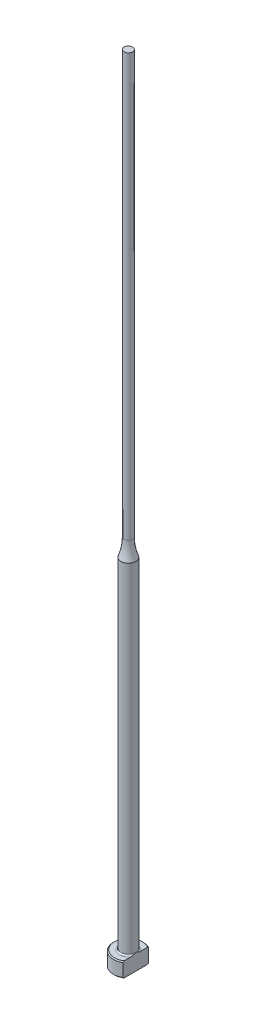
from build123d import *
from build123d.topology import SkipClean

# Parameters (mm, degrees)
CHAMFER1_SIZE = 0.2
FILLET1_R     = 0.3
KEY_DEPTH     = 161.056240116


with BuildPart() as part:
    # Sketch1 → Revolve1 (revolve)
    with BuildSketch(Plane.XY, mode=Mode.PRIVATE) as revolve1_sk:
        with BuildLine():
            Line((0, 0), (-3, 0))
            Line((-3, 0), (-3, 3))
            Line((-3, 3), (-1.5, 3))
            Line((-1.5, 3), (-1.5, 71.453522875))
            ThreePointArc((-1.5, 71.453522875), (-1.013842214, 73.197224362), (-0.85, 75))
            Line((-0.85, 75), (-0.85, 160))
            Line((-0.85, 160), (0, 160))
            Line((0, 160), (0, 0))
        make_face()
    revolve(revolve1_sk.sketch.rotate(Axis((0, 259.958771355, 0), (0, -1, 0)), 270), axis=Axis((0, 259.958771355, 0), (0, -1, 0)))

    # Chamfer1
    chamfer1_edges = [part.edges().sort_by_distance(p)[0] for p in [
        (0, 0, -3),
        (0, 3, -3),
    ]]
    chamfer(chamfer1_edges, length=CHAMFER1_SIZE)

    # Fillet1
    fillet1_edges = [part.edges().sort_by_distance(p)[0] for p in [
        (0, 3, -1.5),
    ]]
    fillet(fillet1_edges, radius=FILLET1_R)

    # Sketch2 → KEY (cut, through all)
    with SkipClean():  # the faces are left unmerged after this step: merging them gives an invalid solid
        with BuildSketch(Plane(origin=(0, 0, 0), x_dir=(1, 0, 0), z_dir=(0, 1, 0))):
            with BuildLine():
                Line((1.5, 2.598076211), (1.5, -2.598076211))
                ThreePointArc((1.5, -2.598076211), (3, 0), (1.5, 2.598076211))
            make_face()
        extrude(amount=KEY_DEPTH, mode=Mode.SUBTRACT)


solid = part.part
